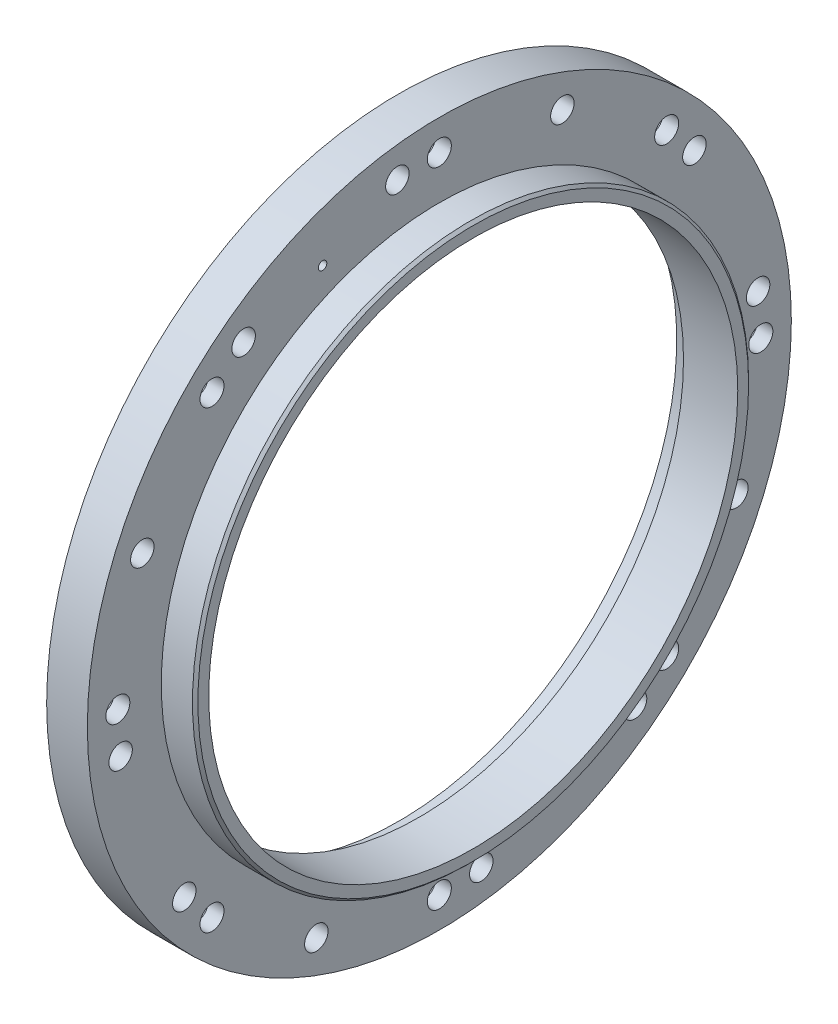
from build123d import *

# Parameters (mm, degrees)
SKETCH1_R                             = 65.913
BOSS_EXTRUDE1_DEPTH                   = 7.62
SKETCH2_R                             = 49.53
CUT_EXTRUDE1_DEPTH                    = 94.525993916
CIRPATTERN1_COUNT                     = 8
CIRPATTERN3_COUNT                     = 12
SKETCH11_R                            = 52.07
BOSS_EXTRUDE2_DEPTH                   = 6.35
SKETCH12_R                            = 49.53
CUT_EXTRUDE2_DEPTH                    = 12.7
CHAMFER1_SIZE                         = 0.508
SKETCH13_R                            = 52.07
CUT_EXTRUDE3_DEPTH                    = 3.81
F_1_16_0_0625_CLEARANCE_DOWEL_HOLE1_D = 1.5875
F_1_16_0_0625_PRESS_DOWEL_HOLE1_D     = 1.5875


with BuildPart() as part:
    # Sketch1 → Boss-Extrude1 (new body)
    with BuildSketch(Plane(origin=(0, 0, 0), x_dir=(0, 0, -1), z_dir=(1, 0, 0))):
        with Locations(Location((0, 0, 0), (0, 0, 180))):
            Circle(SKETCH1_R)
    extrude(amount=BOSS_EXTRUDE1_DEPTH)

    # Sketch2 → Cut-Extrude1 (cut, through all)
    with BuildSketch(Plane(origin=(7.62, 0, 0), x_dir=(0, 0, -1), z_dir=(1, 0, 0))):
        Circle(SKETCH2_R)
    extrude(amount=-CUT_EXTRUDE1_DEPTH, mode=Mode.SUBTRACT)

    # Sketch5 → CBORE for _8 Socket Head Cap Screw1 (revolve, cut)
    with BuildSketch(Plane.ZX.offset(60.198)):
        Polygon((0, 0), (0, 7.62), (2.2479, 7.62), (2.2479, 4.6736), (3.96875, 4.6736), (3.96875, 0.284888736), (4.2164, 0), align=None)
    cbore_for_8_socket_head_cap_screw1 = revolve(axis=Axis((-6.35, 60.198, 0), (1, 0, 0)), mode=Mode.SUBTRACT)

    # CirPattern1: CBORE for _8 Socket Head Cap Screw1 ×8 about axis
    cirpattern1_axis = Axis((0, 0, 0), (1, 0, 0))
    for i in range(1, CIRPATTERN1_COUNT):
        add(cbore_for_8_socket_head_cap_screw1.rotate(cirpattern1_axis, i * 360 / CIRPATTERN1_COUNT), mode=Mode.SUBTRACT)

    # Sketch10 → Tapped Hole for _8-32 Helicoil1 (revolve, cut)
    with BuildSketch(Plane(origin=(0, 55.615700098, -23.036777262), x_dir=(0, 0, 1), z_dir=(0, 1, 0))):
        Polygon((0, 0), (0, 16.839550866), (2.1971, 15.5194), (2.1971, 0), align=None)
    tapped_hole_for_8_32_helicoil1 = revolve(axis=Axis((-6.35, 55.615700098, -23.036777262), (1, 0, 0)), mode=Mode.SUBTRACT)

    # CirPattern3: Tapped Hole for _8-32 Helicoil1 ×12 about axis
    cirpattern3_axis = Axis((0, 0, 0), (1, 0, 0))
    for i in range(1, CIRPATTERN3_COUNT):
        add(tapped_hole_for_8_32_helicoil1.rotate(cirpattern3_axis, i * 360 / CIRPATTERN3_COUNT), mode=Mode.SUBTRACT)

    # Sketch11 → Boss-Extrude2 (add)
    with BuildSketch(Plane(origin=(7.62, 0, 0), x_dir=(0, 0, -1), z_dir=(1, 0, 0))):
        Circle(SKETCH11_R)
    extrude(amount=BOSS_EXTRUDE2_DEPTH)

    # Sketch12 → Cut-Extrude2 (cut)
    with BuildSketch(Plane(origin=(13.97, 0, 0), x_dir=(0, 0, -1), z_dir=(1, 0, 0))):
        Circle(SKETCH12_R)
    extrude(amount=-CUT_EXTRUDE2_DEPTH, mode=Mode.SUBTRACT)

    # Chamfer1
    chamfer1_edges = [part.edges().sort_by_distance(p)[0] for p in [
        (13.97, 0, 52.07),
    ]]
    chamfer(chamfer1_edges, length=CHAMFER1_SIZE)

    # Sketch13 → Cut-Extrude3 (cut)
    with BuildSketch(Plane.ZY):
        with Locations(Location((0, 0, 0), (0, 0, 180))):
            Circle(SKETCH13_R)
    extrude(amount=-CUT_EXTRUDE3_DEPTH, mode=Mode.SUBTRACT)

    # 1_16 _0.0625_ Clearance Dowel Hole1 (through all)
    with Locations(Plane.ZY):
        with Locations((-21.87035816, -52.799715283)):
            Hole(F_1_16_0_0625_CLEARANCE_DOWEL_HOLE1_D / 2)

    # 1_16 _0.0625_ Press Dowel Hole1 (through all)
    with Locations(Plane.ZY):
        with Locations((21.87035816, 52.799715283)):
            Hole(F_1_16_0_0625_PRESS_DOWEL_HOLE1_D / 2)


solid = part.part
